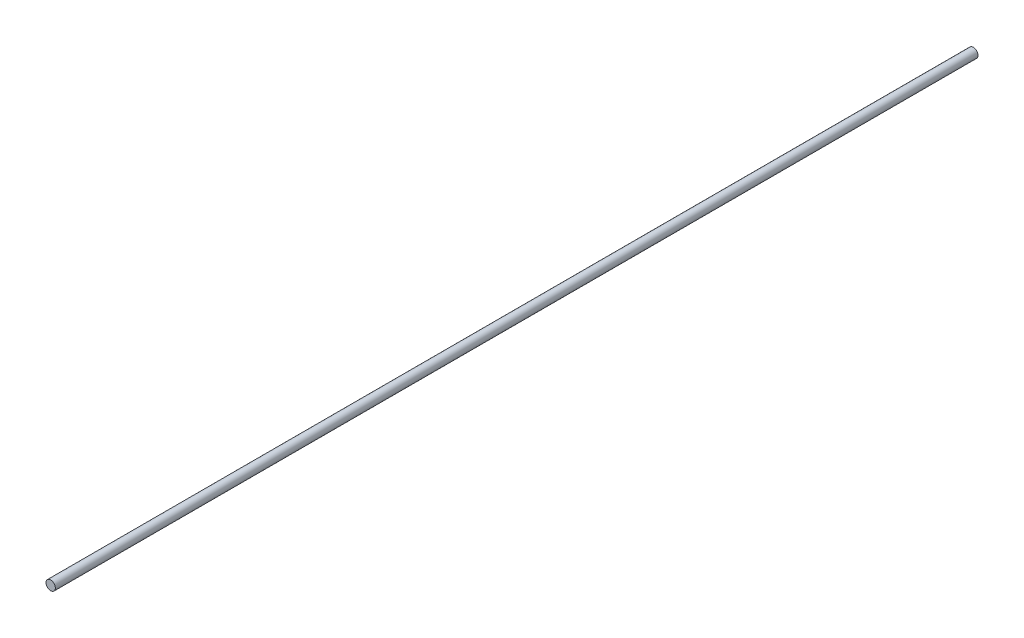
from build123d import *

# Parameters (mm, degrees)
SKETCH1_R           = 30
BOSS_EXTRUDE1_DEPTH = 5900


with BuildPart() as part:
    # Sketch1 → Boss-Extrude1 (new body)
    with BuildSketch(Plane.XY):
        Circle(SKETCH1_R)
    extrude(amount=-BOSS_EXTRUDE1_DEPTH)


solid = part.part
